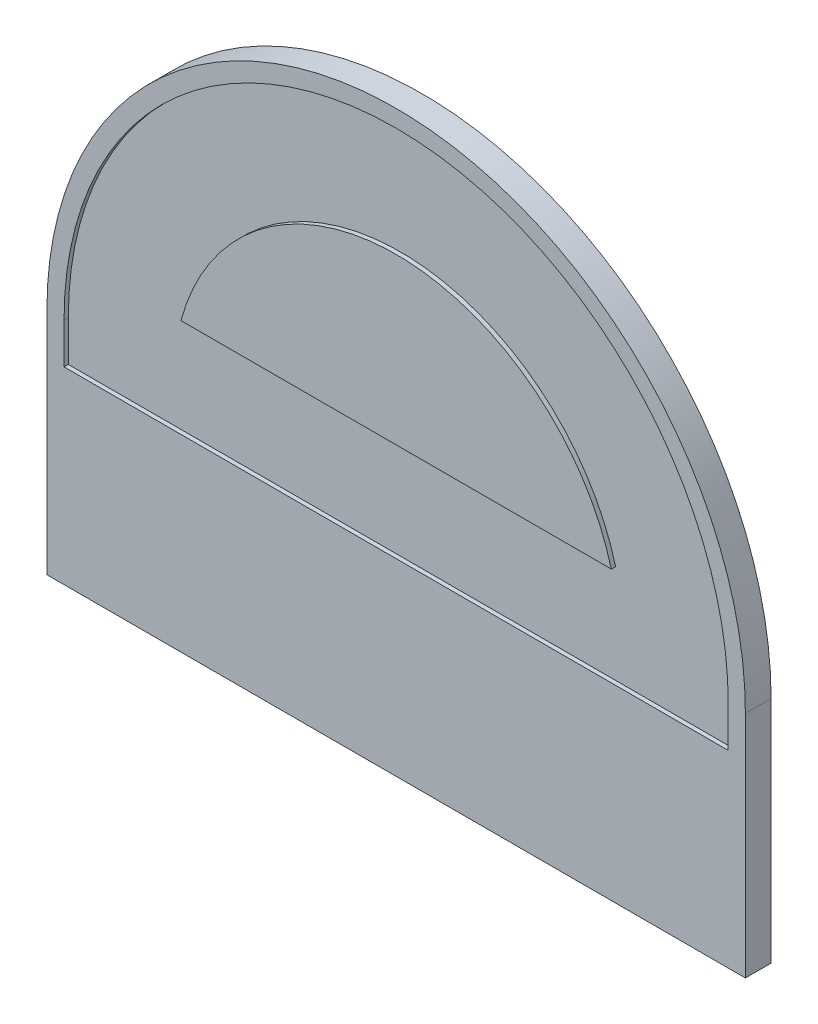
from build123d import *

# Parameters (mm, degrees)
SKETCH1_R      = 3.475
INLAY_DEPTH    = 5
THEREST_DEPTH  = 6
SKETCH1_10_R   = 3.475
AXLEHOLE_DEPTH = 3


with BuildPart() as part:
    # Sketch1 → Inlay (new body)
    # profile 1 of 2: a face of its own
    with BuildSketch(Plane.XY):
        with BuildLine():
            Line((77.5, -9.5), (77.5, 0))
            ThreePointArc((77.5, 0), (0, 77.5), (-77.5, 0))
            Line((-77.5, 0), (-77.5, -9.5))
            Line((-77.5, -9.5), (77.5, -9.5))
        make_face()
        with BuildLine():
            ThreePointArc((50.217028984, 13.5), (0, 52), (-50.217028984, 13.5))
            Line((-50.217028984, 13.5), (50.217028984, 13.5))
        make_face(mode=Mode.SUBTRACT)
    # profile 2 of 2: a face of its own
    with BuildSketch(Plane.XY):
        Circle(SKETCH1_R)
    extrude(amount=INLAY_DEPTH)

    # Sketch1_7 → TheRest (add)
    # profile 1 of 2: a face of its own
    with BuildSketch(Plane.XY):
        with BuildLine():
            Line((81.5, -13.5), (81.5, 0))
            ThreePointArc((81.5, 0), (0, 81.5), (-81.5, 0))
            Line((-81.5, 0), (-81.5, -13.5))
            Line((-81.5, -13.5), (-81.5, -53.5))
            Line((-81.5, -53.5), (81.5, -53.5))
            Line((81.5, -53.5), (81.5, -13.5))
        make_face()
        with BuildLine():
            ThreePointArc((77.5, 0), (0, 77.5), (-77.5, 0))
            Line((-77.5, 0), (-77.5, -9.5))
            Line((-77.5, -9.5), (77.5, -9.5))
            Line((77.5, -9.5), (77.5, 0))
        make_face(mode=Mode.SUBTRACT)
    # profile 2 of 2: a face of its own
    with BuildSketch(Plane.XY):
        with BuildLine():
            Line((-50.217028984, 13.5), (50.217028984, 13.5))
            ThreePointArc((50.217028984, 13.5), (0, 52), (-50.217028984, 13.5))
        make_face()
    extrude(amount=THEREST_DEPTH)

    # Sketch1_10 → AxleHole (cut)
    with BuildSketch(Plane.XY):
        Circle(SKETCH1_10_R)
    extrude(amount=AXLEHOLE_DEPTH, mode=Mode.SUBTRACT)


solid = part.part
